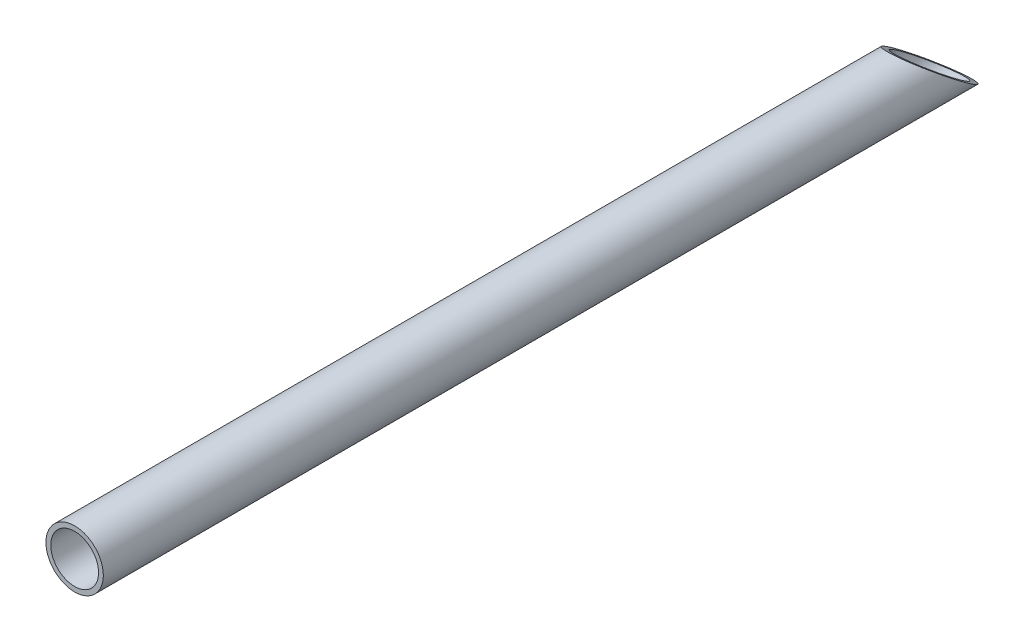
from build123d import *

# Parameters (mm, degrees)
SKIZZE1_R                       = 30
SKIZZE1_R_2                     = 25
AUFSATZ_LINEAR_AUSTRAGEN1_DEPTH = 1000


with BuildPart() as part:
    # Skizze1 → Aufsatz-Linear austragen1 (new body)
    with BuildSketch(Plane.XY):
        Circle(SKIZZE1_R)
        Circle(SKIZZE1_R_2, mode=Mode.SUBTRACT)
    extrude(amount=-AUFSATZ_LINEAR_AUSTRAGEN1_DEPTH)

    # Oberfl_chenschnitt1
    split(bisect_by=Plane(origin=(-17.233620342, 429.5302613, -324.722637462), x_dir=(-0.02416400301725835, 0.6022629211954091, 0.7979319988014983), z_dir=(-0.03198890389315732, 0.7972905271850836, -0.6027474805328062)), keep=Keep.BOTTOM)


solid = part.part
